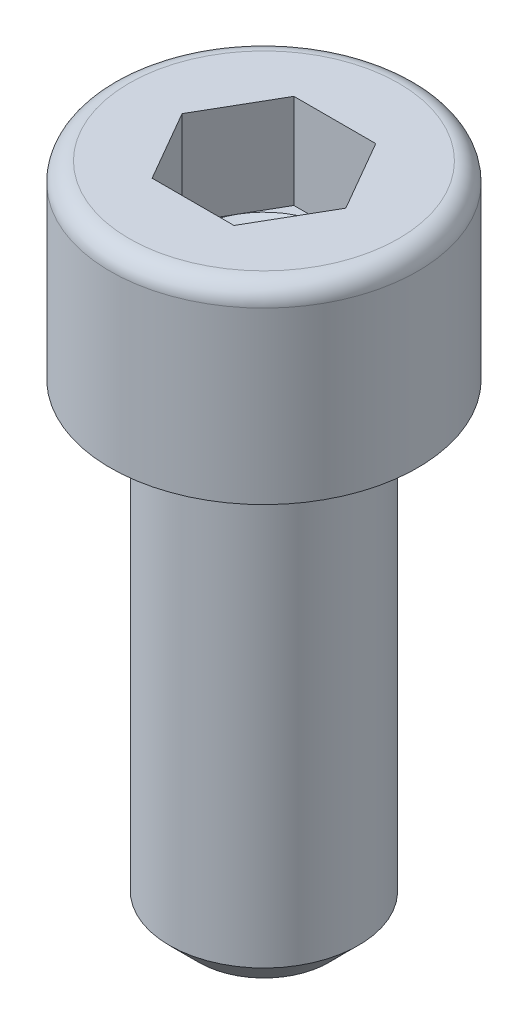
from build123d import *

# Parameters (mm, degrees)
TIGE_START              = -20
ESQUISSE1_R             = 4
TIGE_DEPTH              = 20
CHANFREIN_D_ENTR_E_SIZE = 1.25
HEXAGONE_DEPTH          = 4


with BuildPart() as part:
    # Esquisse1 → Tige (new body)
    with BuildSketch(Plane(origin=(0, 0, 0), x_dir=(1, 0, 0), z_dir=(0, 1, 0)).offset(TIGE_START)):
        with Locations(Location((0, 0, 0), (0, 0, 270))):
            Circle(ESQUISSE1_R)
    extrude(amount=TIGE_DEPTH)

    # Chanfrein d_entr_e
    chanfrein_d_entr_e_edges = [part.edges().sort_by_distance(p)[0] for p in [
        (0, -20, -4),
    ]]
    chamfer(chanfrein_d_entr_e_edges, length=CHANFREIN_D_ENTR_E_SIZE)

    # Esquisse2 → T_te (revolve)
    with BuildSketch(Plane.XY, mode=Mode.PRIVATE) as t_te_sk:
        with BuildLine():
            Line((3, 8), (3, 4))
            Line((3, 4), (0, 2.267949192))
            Line((0, 2.267949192), (0, 0))
            Line((0, 0), (6.5, 0))
            Line((6.5, 0), (6.5, 7.2))
            ThreePointArc((6.5, 7.2), (6.265685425, 7.765685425), (5.7, 8))
            Line((5.7, 8), (3, 8))
        make_face()
    revolve(t_te_sk.sketch.rotate(Axis((0, 8, 0), (0, -1, 0)), 180), axis=Axis((0, 8, 0), (0, -1, 0)))

    # Esquisse3 → Hexagone (cut)
    with BuildSketch(Plane(origin=(0, 8, -3), x_dir=(1, 0, 0), z_dir=(0, -1, 0))):
        Polygon((1.732050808, 6), (-1.732050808, 6), (-3.464101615, 3), (-1.732050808, 0), (1.732050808, 0), (3.464101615, 3), align=None)
    extrude(amount=HEXAGONE_DEPTH, mode=Mode.SUBTRACT)


solid = part.part
